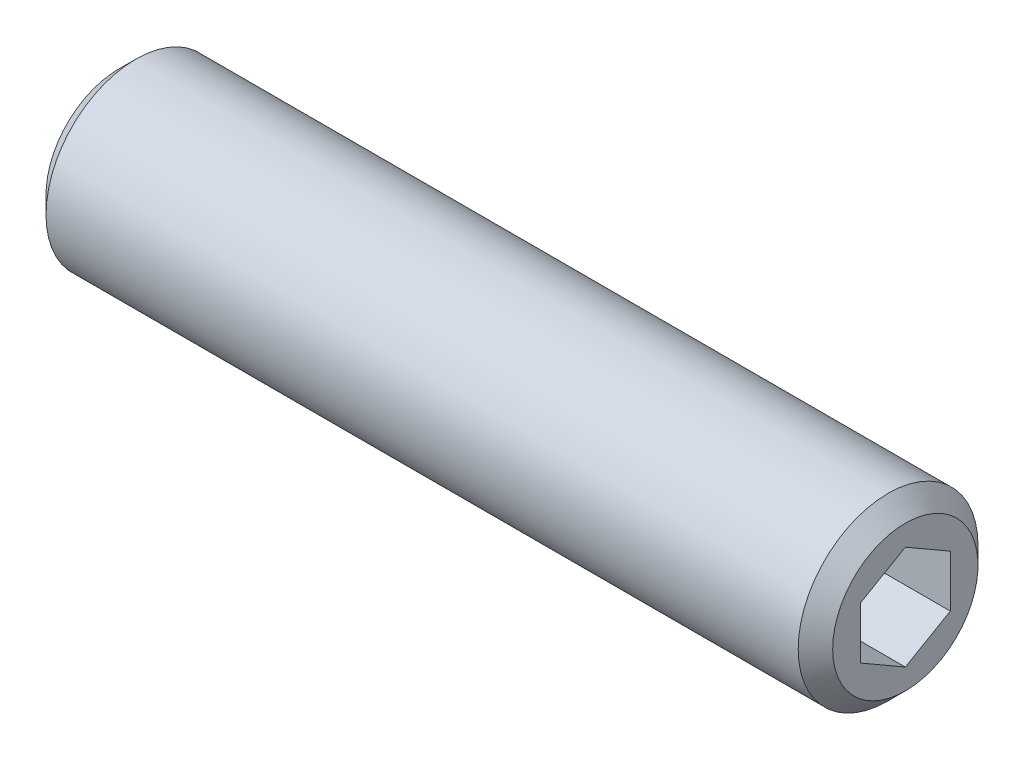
ISO-10303-21;
HEADER;
FILE_DESCRIPTION(('STEP AP214'),'2;1');
FILE_NAME('part.step','',(''),(''),'','','');
FILE_SCHEMA(('AUTOMOTIVE_DESIGN { 1 0 10303 214 1 1 1 1 }'));
ENDSEC;
DATA;
#1=APPLICATION_CONTEXT('core data for automotive mechanical design processes');
#2=APPLICATION_PROTOCOL_DEFINITION('international standard','automotive_design',2000,#1);
#3=PRODUCT_CONTEXT('',#1,'mechanical');
#4=PRODUCT('Part','Part','',(#3));
#5=PRODUCT_RELATED_PRODUCT_CATEGORY('part','',(#4));
#6=PRODUCT_DEFINITION_FORMATION('','',#4);
#7=PRODUCT_DEFINITION_CONTEXT('part definition',#1,'design');
#8=PRODUCT_DEFINITION('design','',#6,#7);
#9=PRODUCT_DEFINITION_SHAPE('','',#8);
#10=(LENGTH_UNIT() NAMED_UNIT(*) SI_UNIT(.MILLI.,.METRE.));
#11=(NAMED_UNIT(*) PLANE_ANGLE_UNIT() SI_UNIT($,.RADIAN.));
#12=(NAMED_UNIT(*) SI_UNIT($,.STERADIAN.) SOLID_ANGLE_UNIT());
#13=UNCERTAINTY_MEASURE_WITH_UNIT(LENGTH_MEASURE(1.E-05),#10,'distance_accuracy_value','');
#14=(GEOMETRIC_REPRESENTATION_CONTEXT(3) GLOBAL_UNCERTAINTY_ASSIGNED_CONTEXT((#13)) GLOBAL_UNIT_ASSIGNED_CONTEXT((#10,
#11,#12)) REPRESENTATION_CONTEXT('',''));
#15=CARTESIAN_POINT('',(0.,0.,0.));
#16=DIRECTION('',(0.,0.,1.));
#17=DIRECTION('',(1.,0.,0.));
#18=AXIS2_PLACEMENT_3D('',#15,#16,#17);
#19=CARTESIAN_POINT('',(30.0080000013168,0.,0.));
#20=DIRECTION('',(1.,0.,0.));
#21=DIRECTION('',(0.,0.,-1.));
#22=AXIS2_PLACEMENT_3D('',#19,#20,#21);
#23=CONICAL_SURFACE('',#22,2.32325748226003,1.04719754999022);
#24=CARTESIAN_POINT('',(28.666666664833,5.6843418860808E-11,0.));
#25=VERTEX_POINT('',#24);
#26=VERTEX_LOOP('',#25);
#27=FACE_BOUND('',#26,.T.);
#28=CARTESIAN_POINT('',(30.0000000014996,-1.15470053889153,1.99999999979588));
#29=CARTESIAN_POINT('',(29.9706955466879,-1.20544263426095,1.91211211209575));
#30=CARTESIAN_POINT('',(29.9440446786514,-1.25662273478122,1.82346557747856));
#31=CARTESIAN_POINT('',(29.8975263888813,-1.35986908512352,1.64463765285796));
#32=CARTESIAN_POINT('',(29.8776754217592,-1.41193716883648,1.55445308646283));
#33=CARTESIAN_POINT('',(29.8467759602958,-1.51542808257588,1.37520156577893));
#34=CARTESIAN_POINT('',(29.8355217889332,-1.56683499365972,1.28616218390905));
#35=CARTESIAN_POINT('',(29.8220891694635,-1.66989057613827,1.10766467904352));
#36=CARTESIAN_POINT('',(29.8198995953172,-1.72153887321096,1.01820720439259));
#37=CARTESIAN_POINT('',(29.8244662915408,-1.81803817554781,0.851065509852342));
#38=CARTESIAN_POINT('',(29.8301012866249,-1.86290366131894,0.773356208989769));
#39=CARTESIAN_POINT('',(29.8479573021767,-1.95234234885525,0.618443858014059));
#40=CARTESIAN_POINT('',(29.8601844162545,-1.99691524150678,0.541241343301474));
#41=CARTESIAN_POINT('',(29.8907498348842,-2.08653818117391,0.386009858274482));
#42=CARTESIAN_POINT('',(29.9092176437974,-2.13157689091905,0.308000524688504));
#43=CARTESIAN_POINT('',(29.9511317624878,-2.22098275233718,0.15314503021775));
#44=CARTESIAN_POINT('',(29.9745682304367,-2.26535104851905,0.0762968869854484));
#45=CARTESIAN_POINT('',(30.0000000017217,-2.30940107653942,3.79406241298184E-10));
#46=B_SPLINE_CURVE_WITH_KNOTS('',3,(#28,#29,#30,#31,#32,#33,#34,#35,#36,#37,#38,#39,#40,#41,#42,
#43,#44,#45),.UNSPECIFIED.,.F.,.F.,(4,2,2,2,2,2,2,2,4),(0.,0.317016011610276,0.634793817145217,
0.944707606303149,1.25424088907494,1.52370778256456,1.79342419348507,2.06912162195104,
2.34427797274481),.UNSPECIFIED.);
#47=CARTESIAN_POINT('',(30.000000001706,-1.15470053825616,1.99999999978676));
#48=VERTEX_POINT('',#47);
#49=CARTESIAN_POINT('',(30.0000000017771,-2.30940107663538,2.13202127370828E-10));
#50=VERTEX_POINT('',#49);
#51=EDGE_CURVE('E20',#48,#50,#46,.T.);
#52=ORIENTED_EDGE('',*,*,#51,.T.);
#53=CARTESIAN_POINT('',(30.0000000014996,-2.30940107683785,-5.45718177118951E-10));
#54=CARTESIAN_POINT('',(29.9706955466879,-2.2586589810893,-0.0878878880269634));
#55=CARTESIAN_POINT('',(29.9440446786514,-2.2074788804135,-0.176534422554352));
#56=CARTESIAN_POINT('',(29.8975263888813,-2.10423252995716,-0.355362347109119));
#57=CARTESIAN_POINT('',(29.8776754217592,-2.05216444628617,-0.445546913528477));
#58=CARTESIAN_POINT('',(29.8467759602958,-1.94867353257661,-0.624798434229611));
#59=CARTESIAN_POINT('',(29.8355217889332,-1.89726662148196,-0.713837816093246));
#60=CARTESIAN_POINT('',(29.8220891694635,-1.79421103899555,-0.892335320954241));
#61=CARTESIAN_POINT('',(29.8198995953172,-1.74256274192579,-0.98179279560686));
#62=CARTESIAN_POINT('',(29.8244662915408,-1.64606343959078,-1.14893449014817));
#63=CARTESIAN_POINT('',(29.8301012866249,-1.60119795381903,-1.22664379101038));
#64=CARTESIAN_POINT('',(29.8479573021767,-1.51175926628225,-1.38155614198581));
#65=CARTESIAN_POINT('',(29.8601844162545,-1.46718637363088,-1.45875865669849));
#66=CARTESIAN_POINT('',(29.8907498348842,-1.37756343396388,-1.61399014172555));
#67=CARTESIAN_POINT('',(29.9092176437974,-1.3325247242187,-1.69199947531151));
#68=CARTESIAN_POINT('',(29.9511317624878,-1.2431188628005,-1.84685496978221));
#69=CARTESIAN_POINT('',(29.9745682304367,-1.19875056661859,-1.92370311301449));
#70=CARTESIAN_POINT('',(30.0000000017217,-1.15470053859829,-1.99999999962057));
#71=B_SPLINE_CURVE_WITH_KNOTS('',3,(#53,#54,#55,#56,#57,#58,#59,#60,#61,#62,#63,#64,#65,#66,#67,
#68,#69,#70),.UNSPECIFIED.,.F.,.F.,(4,2,2,2,2,2,2,2,4),(0.,0.317016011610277,0.634793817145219,
0.944707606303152,1.25424088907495,1.52370778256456,1.79342419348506,2.06912162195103,
2.34427797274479),.UNSPECIFIED.);
#72=CARTESIAN_POINT('',(30.0000000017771,-1.15470053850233,-1.99999999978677));
#73=VERTEX_POINT('',#72);
#74=EDGE_CURVE('E110',#50,#73,#71,.T.);
#75=ORIENTED_EDGE('',*,*,#74,.T.);
#76=CARTESIAN_POINT('',(30.0000000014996,-1.15470053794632,-2.00000000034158));
#77=CARTESIAN_POINT('',(29.9706955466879,-1.05321634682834,-2.00000000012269));
#78=CARTESIAN_POINT('',(29.9440446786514,-0.950856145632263,-2.0000000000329));
#79=CARTESIAN_POINT('',(29.8975263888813,-0.744363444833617,-1.99999999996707));
#80=CARTESIAN_POINT('',(29.8776754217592,-0.640227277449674,-1.9999999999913));
#81=CARTESIAN_POINT('',(29.8467759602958,-0.433245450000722,-2.00000000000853));
#82=CARTESIAN_POINT('',(29.8355217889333,-0.330431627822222,-2.00000000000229));
#83=CARTESIAN_POINT('',(29.8220891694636,-0.124320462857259,-1.99999999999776));
#84=CARTESIAN_POINT('',(29.8198995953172,-0.0210238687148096,-1.99999999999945));
#85=CARTESIAN_POINT('',(29.8244662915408,0.171974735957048,-2.00000000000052));
#86=CARTESIAN_POINT('',(29.8301012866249,0.261705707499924,-2.00000000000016));
#87=CARTESIAN_POINT('',(29.8479573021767,0.440583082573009,-1.99999999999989));
#88=CARTESIAN_POINT('',(29.8601844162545,0.529728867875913,-1.99999999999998));
#89=CARTESIAN_POINT('',(29.8907498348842,0.708974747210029,-2.00000000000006));
#90=CARTESIAN_POINT('',(29.9092176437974,0.799052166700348,-2.00000000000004));
#91=CARTESIAN_POINT('',(29.9511317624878,0.977863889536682,-2.));
#92=CARTESIAN_POINT('',(29.9745682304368,1.06660048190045,-1.99999999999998));
#93=CARTESIAN_POINT('',(30.0000000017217,1.15470053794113,-2.00000000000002));
#94=B_SPLINE_CURVE_WITH_KNOTS('',3,(#76,#77,#78,#79,#80,#81,#82,#83,#84,#85,#86,#87,#88,#89,#90,
#91,#92,#93),.UNSPECIFIED.,.F.,.F.,(4,2,2,2,2,2,2,2,4),(0.,0.317016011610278,0.634793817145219,
0.944707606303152,1.25424088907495,1.52370778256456,1.79342419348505,2.06912162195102,
2.34427797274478),.UNSPECIFIED.);
#95=CARTESIAN_POINT('',(30.0000000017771,1.15470053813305,-2.));
#96=VERTEX_POINT('',#95);
#97=EDGE_CURVE('E106',#73,#96,#94,.T.);
#98=ORIENTED_EDGE('',*,*,#97,.T.);
#99=CARTESIAN_POINT('',(30.0000000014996,1.15470053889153,-1.99999999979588));
#100=CARTESIAN_POINT('',(29.9706955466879,1.20544263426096,-1.91211211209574));
#101=CARTESIAN_POINT('',(29.9440446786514,1.25662273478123,-1.82346557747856));
#102=CARTESIAN_POINT('',(29.8975263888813,1.35986908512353,-1.64463765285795));
#103=CARTESIAN_POINT('',(29.8776754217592,1.41193716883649,-1.55445308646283));
#104=CARTESIAN_POINT('',(29.8467759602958,1.51542808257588,-1.37520156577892));
#105=CARTESIAN_POINT('',(29.8355217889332,1.56683499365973,-1.28616218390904));
#106=CARTESIAN_POINT('',(29.8220891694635,1.66989057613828,-1.10766467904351));
#107=CARTESIAN_POINT('',(29.8198995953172,1.72153887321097,-1.01820720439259));
#108=CARTESIAN_POINT('',(29.8244662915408,1.81803817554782,-0.851065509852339));
#109=CARTESIAN_POINT('',(29.8301012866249,1.86290366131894,-0.773356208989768));
#110=CARTESIAN_POINT('',(29.8479573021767,1.95234234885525,-0.618443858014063));
#111=CARTESIAN_POINT('',(29.8601844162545,1.99691524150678,-0.54124134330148));
#112=CARTESIAN_POINT('',(29.8907498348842,2.08653818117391,-0.386009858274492));
#113=CARTESIAN_POINT('',(29.9092176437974,2.13157689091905,-0.308000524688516));
#114=CARTESIAN_POINT('',(29.9511317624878,2.22098275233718,-0.153145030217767));
#115=CARTESIAN_POINT('',(29.9745682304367,2.26535104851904,-0.0762968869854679));
#116=CARTESIAN_POINT('',(30.0000000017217,2.30940107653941,-3.79427652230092E-10));
#117=B_SPLINE_CURVE_WITH_KNOTS('',3,(#99,#100,#101,#102,#103,#104,#105,#106,#107,#108,#109,#110,
#111,#112,#113,#114,#115,#116),.UNSPECIFIED.,.F.,.F.,(4,2,2,2,2,2,2,2,4),(0.,0.317016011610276,
0.634793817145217,0.94470760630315,1.25424088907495,1.52370778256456,1.79342419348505,
2.06912162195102,2.34427797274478),.UNSPECIFIED.);
#118=CARTESIAN_POINT('',(30.0000000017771,2.30940107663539,-2.13231902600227E-10));
#119=VERTEX_POINT('',#118);
#120=EDGE_CURVE('E102',#96,#119,#117,.T.);
#121=ORIENTED_EDGE('',*,*,#120,.T.);
#122=CARTESIAN_POINT('',(30.0000000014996,2.30940107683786,5.45690230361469E-10));
#123=CARTESIAN_POINT('',(29.9706955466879,2.25865898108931,0.0878878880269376));
#124=CARTESIAN_POINT('',(29.9440446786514,2.20747888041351,0.176534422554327));
#125=CARTESIAN_POINT('',(29.8975263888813,2.10423252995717,0.355362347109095));
#126=CARTESIAN_POINT('',(29.8776754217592,2.05216444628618,0.445546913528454));
#127=CARTESIAN_POINT('',(29.8467759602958,1.94867353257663,0.624798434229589));
#128=CARTESIAN_POINT('',(29.8355217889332,1.89726662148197,0.713837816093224));
#129=CARTESIAN_POINT('',(29.8220891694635,1.79421103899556,0.89233532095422));
#130=CARTESIAN_POINT('',(29.8198995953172,1.7425627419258,0.98179279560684));
#131=CARTESIAN_POINT('',(29.8244662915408,1.64606343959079,1.14893449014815));
#132=CARTESIAN_POINT('',(29.8301012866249,1.60119795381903,1.22664379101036));
#133=CARTESIAN_POINT('',(29.8479573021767,1.51175926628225,1.3815561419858));
#134=CARTESIAN_POINT('',(29.8601844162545,1.46718637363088,1.45875865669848));
#135=CARTESIAN_POINT('',(29.8907498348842,1.37756343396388,1.61399014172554));
#136=CARTESIAN_POINT('',(29.9092176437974,1.3325247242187,1.6919994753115));
#137=CARTESIAN_POINT('',(29.9511317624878,1.2431188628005,1.84685496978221));
#138=CARTESIAN_POINT('',(29.9745682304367,1.19875056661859,1.92370311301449));
#139=CARTESIAN_POINT('',(30.0000000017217,1.15470053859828,1.99999999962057));
#140=B_SPLINE_CURVE_WITH_KNOTS('',3,(#122,#123,#124,#125,#126,#127,#128,#129,#130,#131,#132,
#133,#134,#135,#136,#137,#138,#139),.UNSPECIFIED.,.F.,.F.,(4,2,2,2,2,2,2,2,4),(0.,
0.317016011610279,0.634793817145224,0.944707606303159,1.25424088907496,1.52370778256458,
1.79342419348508,2.06912162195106,2.34427797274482),.UNSPECIFIED.);
#141=CARTESIAN_POINT('',(30.0000000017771,1.15470053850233,1.99999999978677));
#142=VERTEX_POINT('',#141);
#143=EDGE_CURVE('E85',#119,#142,#140,.T.);
#144=ORIENTED_EDGE('',*,*,#143,.T.);
#145=CARTESIAN_POINT('',(30.0000000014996,1.15470053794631,2.00000000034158));
#146=CARTESIAN_POINT('',(29.9706955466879,1.05321634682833,2.00000000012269));
#147=CARTESIAN_POINT('',(29.9440446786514,0.950856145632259,2.0000000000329));
#148=CARTESIAN_POINT('',(29.8975263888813,0.744363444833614,1.99999999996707));
#149=CARTESIAN_POINT('',(29.8776754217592,0.640227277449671,1.9999999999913));
#150=CARTESIAN_POINT('',(29.8467759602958,0.433245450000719,2.00000000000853));
#151=CARTESIAN_POINT('',(29.8355217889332,0.33043162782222,2.00000000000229));
#152=CARTESIAN_POINT('',(29.8220891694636,0.124320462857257,1.99999999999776));
#153=CARTESIAN_POINT('',(29.8198995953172,0.0210238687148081,1.99999999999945));
#154=CARTESIAN_POINT('',(29.8244662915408,-0.171974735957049,2.00000000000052));
#155=CARTESIAN_POINT('',(29.8301012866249,-0.261705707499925,2.00000000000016));
#156=CARTESIAN_POINT('',(29.8479573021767,-0.440583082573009,1.99999999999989));
#157=CARTESIAN_POINT('',(29.8601844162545,-0.529728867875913,1.99999999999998));
#158=CARTESIAN_POINT('',(29.8907498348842,-0.708974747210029,2.00000000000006));
#159=CARTESIAN_POINT('',(29.9092176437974,-0.799052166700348,2.00000000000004));
#160=CARTESIAN_POINT('',(29.9511317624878,-0.977863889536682,2.));
#161=CARTESIAN_POINT('',(29.9745682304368,-1.06660048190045,1.99999999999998));
#162=CARTESIAN_POINT('',(30.0000000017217,-1.15470053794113,2.00000000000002));
#163=B_SPLINE_CURVE_WITH_KNOTS('',3,(#145,#146,#147,#148,#149,#150,#151,#152,#153,#154,#155,
#156,#157,#158,#159,#160,#161,#162),.UNSPECIFIED.,.F.,.F.,(4,2,2,2,2,2,2,2,4),(0.,
0.317016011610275,0.634793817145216,0.944707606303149,1.25424088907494,1.52370778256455,
1.79342419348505,2.06912162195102,2.34427797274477),.UNSPECIFIED.);
#164=EDGE_CURVE('E83',#142,#48,#163,.T.);
#165=ORIENTED_EDGE('',*,*,#164,.T.);
#166=EDGE_LOOP('',(#52,#75,#98,#121,#144,#165));
#167=FACE_BOUND('',#166,.T.);
#168=ADVANCED_FACE('F16',(#27,#167),#23,.F.);
#169=CARTESIAN_POINT('',(35.,-1.15470053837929,1.99999999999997));
#170=DIRECTION('',(0.,-0.866025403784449,0.499999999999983));
#171=DIRECTION('',(0.,-0.499999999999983,-0.866025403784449));
#172=AXIS2_PLACEMENT_3D('',#169,#170,#171);
#173=PLANE('',#172);
#174=DIRECTION('',(1.,0.,0.));
#175=VECTOR('',#174,1.);
#176=CARTESIAN_POINT('',(35.,-1.15470053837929,2.00000000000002));
#177=LINE('',#176,#175);
#178=CARTESIAN_POINT('',(35.,-1.15470053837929,2.00000000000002));
#179=VERTEX_POINT('',#178);
#180=EDGE_CURVE('E76',#48,#179,#177,.T.);
#181=ORIENTED_EDGE('',*,*,#180,.T.);
#182=DIRECTION('',(0.,-0.499999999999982,-0.866025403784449));
#183=VECTOR('',#182,1.);
#184=CARTESIAN_POINT('',(35.,-1.15470053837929,1.99999999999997));
#185=LINE('',#184,#183);
#186=CARTESIAN_POINT('',(35.,-2.3094010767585,0.));
#187=VERTEX_POINT('',#186);
#188=EDGE_CURVE('E87',#179,#187,#185,.T.);
#189=ORIENTED_EDGE('',*,*,#188,.T.);
#190=DIRECTION('',(1.,0.,0.));
#191=VECTOR('',#190,1.);
#192=CARTESIAN_POINT('',(35.,-2.3094010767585,0.));
#193=LINE('',#192,#191);
#194=EDGE_CURVE('E79',#187,#50,#193,.F.);
#195=ORIENTED_EDGE('',*,*,#194,.T.);
#196=ORIENTED_EDGE('',*,*,#51,.F.);
#197=EDGE_LOOP('',(#181,#189,#195,#196));
#198=FACE_BOUND('',#197,.T.);
#199=ADVANCED_FACE('F74',(#198),#173,.F.);
#200=CARTESIAN_POINT('',(35.,-2.3094010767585,0.));
#201=DIRECTION('',(0.,-0.866025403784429,-0.500000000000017));
#202=DIRECTION('',(0.,0.500000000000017,-0.866025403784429));
#203=AXIS2_PLACEMENT_3D('',#200,#201,#202);
#204=PLANE('',#203);
#205=ORIENTED_EDGE('',*,*,#194,.F.);
#206=DIRECTION('',(0.,0.500000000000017,-0.866025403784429));
#207=VECTOR('',#206,1.);
#208=CARTESIAN_POINT('',(35.,-2.3094010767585,0.));
#209=LINE('',#208,#207);
#210=CARTESIAN_POINT('',(35.,-1.15470053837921,-2.00000000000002));
#211=VERTEX_POINT('',#210);
#212=EDGE_CURVE('E117',#187,#211,#209,.T.);
#213=ORIENTED_EDGE('',*,*,#212,.T.);
#214=DIRECTION('',(-1.,0.,0.));
#215=VECTOR('',#214,1.);
#216=CARTESIAN_POINT('',(35.,-1.15470053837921,-2.00000000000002));
#217=LINE('',#216,#215);
#218=EDGE_CURVE('E107',#211,#73,#217,.T.);
#219=ORIENTED_EDGE('',*,*,#218,.T.);
#220=ORIENTED_EDGE('',*,*,#74,.F.);
#221=EDGE_LOOP('',(#205,#213,#219,#220));
#222=FACE_BOUND('',#221,.T.);
#223=ADVANCED_FACE('F162',(#222),#204,.F.);
#224=CARTESIAN_POINT('',(35.,-1.15470053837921,-2.00000000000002));
#225=DIRECTION('',(0.,0.,-1.));
#226=DIRECTION('',(-1.,0.,0.));
#227=AXIS2_PLACEMENT_3D('',#224,#225,#226);
#228=PLANE('',#227);
#229=ORIENTED_EDGE('',*,*,#218,.F.);
#230=DIRECTION('',(0.,1.,0.));
#231=VECTOR('',#230,1.);
#232=CARTESIAN_POINT('',(35.,0.,-2.00000000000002));
#233=LINE('',#232,#231);
#234=CARTESIAN_POINT('',(35.,1.15470053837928,-1.99999999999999));
#235=VERTEX_POINT('',#234);
#236=EDGE_CURVE('E119',#211,#235,#233,.T.);
#237=ORIENTED_EDGE('',*,*,#236,.T.);
#238=DIRECTION('',(1.,0.,0.));
#239=VECTOR('',#238,1.);
#240=CARTESIAN_POINT('',(35.,1.15470053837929,-1.99999999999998));
#241=LINE('',#240,#239);
#242=EDGE_CURVE('E103',#235,#96,#241,.F.);
#243=ORIENTED_EDGE('',*,*,#242,.T.);
#244=ORIENTED_EDGE('',*,*,#97,.F.);
#245=EDGE_LOOP('',(#229,#237,#243,#244));
#246=FACE_BOUND('',#245,.T.);
#247=ADVANCED_FACE('F148',(#246),#228,.F.);
#248=CARTESIAN_POINT('',(35.,1.15470053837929,-1.99999999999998));
#249=DIRECTION('',(0.,0.866025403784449,-0.499999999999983));
#250=DIRECTION('',(0.,0.499999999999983,0.866025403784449));
#251=AXIS2_PLACEMENT_3D('',#248,#249,#250);
#252=PLANE('',#251);
#253=ORIENTED_EDGE('',*,*,#242,.F.);
#254=DIRECTION('',(0.,0.499999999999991,0.866025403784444));
#255=VECTOR('',#254,1.);
#256=CARTESIAN_POINT('',(35.,1.15470053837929,-1.99999999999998));
#257=LINE('',#256,#255);
#258=CARTESIAN_POINT('',(35.,2.30940107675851,0.));
#259=VERTEX_POINT('',#258);
#260=EDGE_CURVE('E113',#235,#259,#257,.T.);
#261=ORIENTED_EDGE('',*,*,#260,.T.);
#262=DIRECTION('',(1.,0.,0.));
#263=VECTOR('',#262,1.);
#264=CARTESIAN_POINT('',(35.,2.30940107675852,0.));
#265=LINE('',#264,#263);
#266=EDGE_CURVE('E96',#259,#119,#265,.F.);
#267=ORIENTED_EDGE('',*,*,#266,.T.);
#268=ORIENTED_EDGE('',*,*,#120,.F.);
#269=EDGE_LOOP('',(#253,#261,#267,#268));
#270=FACE_BOUND('',#269,.T.);
#271=ADVANCED_FACE('F144',(#270),#252,.F.);
#272=CARTESIAN_POINT('',(35.,2.3094010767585,0.));
#273=DIRECTION('',(0.,0.866025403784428,0.500000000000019));
#274=DIRECTION('',(0.,-0.500000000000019,0.866025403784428));
#275=AXIS2_PLACEMENT_3D('',#272,#273,#274);
#276=PLANE('',#275);
#277=ORIENTED_EDGE('',*,*,#266,.F.);
#278=DIRECTION('',(0.,-0.50000000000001,0.866025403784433));
#279=VECTOR('',#278,1.);
#280=CARTESIAN_POINT('',(35.,2.3094010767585,0.));
#281=LINE('',#280,#279);
#282=CARTESIAN_POINT('',(35.,1.15470053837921,2.00000000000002));
#283=VERTEX_POINT('',#282);
#284=EDGE_CURVE('E38',#259,#283,#281,.T.);
#285=ORIENTED_EDGE('',*,*,#284,.T.);
#286=DIRECTION('',(1.,0.,0.));
#287=VECTOR('',#286,1.);
#288=CARTESIAN_POINT('',(35.,1.15470053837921,2.00000000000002));
#289=LINE('',#288,#287);
#290=EDGE_CURVE('E88',#283,#142,#289,.F.);
#291=ORIENTED_EDGE('',*,*,#290,.T.);
#292=ORIENTED_EDGE('',*,*,#143,.F.);
#293=EDGE_LOOP('',(#277,#285,#291,#292));
#294=FACE_BOUND('',#293,.T.);
#295=ADVANCED_FACE('F139',(#294),#276,.F.);
#296=CARTESIAN_POINT('',(35.,1.15470053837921,2.00000000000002));
#297=DIRECTION('',(0.,0.,1.));
#298=DIRECTION('',(1.,0.,0.));
#299=AXIS2_PLACEMENT_3D('',#296,#297,#298);
#300=PLANE('',#299);
#301=ORIENTED_EDGE('',*,*,#290,.F.);
#302=DIRECTION('',(0.,1.,0.));
#303=VECTOR('',#302,1.);
#304=CARTESIAN_POINT('',(35.,0.,2.00000000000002));
#305=LINE('',#304,#303);
#306=EDGE_CURVE('E92',#283,#179,#305,.F.);
#307=ORIENTED_EDGE('',*,*,#306,.T.);
#308=ORIENTED_EDGE('',*,*,#180,.F.);
#309=ORIENTED_EDGE('',*,*,#164,.F.);
#310=EDGE_LOOP('',(#301,#307,#308,#309));
#311=FACE_BOUND('',#310,.T.);
#312=ADVANCED_FACE('F90',(#311),#300,.F.);
#313=CARTESIAN_POINT('',(35.,0.,0.));
#314=DIRECTION('',(-1.,0.,0.));
#315=DIRECTION('',(0.,0.,1.));
#316=AXIS2_PLACEMENT_3D('',#313,#314,#315);
#317=PLANE('',#316);
#318=ORIENTED_EDGE('',*,*,#284,.F.);
#319=ORIENTED_EDGE('',*,*,#260,.F.);
#320=ORIENTED_EDGE('',*,*,#236,.F.);
#321=ORIENTED_EDGE('',*,*,#212,.F.);
#322=ORIENTED_EDGE('',*,*,#188,.F.);
#323=ORIENTED_EDGE('',*,*,#306,.F.);
#324=EDGE_LOOP('',(#318,#319,#320,#321,#322,#323));
#325=FACE_BOUND('',#324,.T.);
#326=CARTESIAN_POINT('',(35.0000000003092,0.,0.));
#327=DIRECTION('',(-1.,0.,0.));
#328=DIRECTION('',(0.,0.,1.));
#329=AXIS2_PLACEMENT_3D('',#326,#327,#328);
#330=CIRCLE('',#329,3.23318750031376);
#331=CARTESIAN_POINT('',(35.0000000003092,0.,3.23318750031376));
#332=VERTEX_POINT('',#331);
#333=EDGE_CURVE('E115',#332,#332,#330,.T.);
#334=ORIENTED_EDGE('',*,*,#333,.F.);
#335=EDGE_LOOP('',(#334));
#336=FACE_BOUND('',#335,.T.);
#337=ADVANCED_FACE('F138',(#325,#336),#317,.F.);
#338=CARTESIAN_POINT('',(0.,2.,0.));
#339=DIRECTION('',(-1.,0.,0.));
#340=DIRECTION('',(0.,0.,1.));
#341=AXIS2_PLACEMENT_3D('',#338,#339,#340);
#342=PLANE('',#341);
#343=CARTESIAN_POINT('',(-3.41060621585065E-10,0.,0.));
#344=DIRECTION('',(1.,0.,0.));
#345=DIRECTION('',(0.,1.,0.));
#346=AXIS2_PLACEMENT_3D('',#343,#344,#345);
#347=CIRCLE('',#346,3.23318750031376);
#348=CARTESIAN_POINT('',(-3.41060796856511E-10,3.23318750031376,0.));
#349=VERTEX_POINT('',#348);
#350=EDGE_CURVE('E122',#349,#349,#347,.T.);
#351=ORIENTED_EDGE('',*,*,#350,.F.);
#352=EDGE_LOOP('',(#351));
#353=FACE_BOUND('',#352,.T.);
#354=ADVANCED_FACE('F187',(#353),#342,.T.);
#355=CARTESIAN_POINT('',(34.2331874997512,0.,0.));
#356=DIRECTION('',(-1.,0.,0.));
#357=DIRECTION('',(0.,0.,1.));
#358=AXIS2_PLACEMENT_3D('',#355,#356,#357);
#359=CONICAL_SURFACE('',#358,3.99999999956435,0.785398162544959);
#360=ORIENTED_EDGE('',*,*,#333,.T.);
#361=EDGE_LOOP('',(#360));
#362=FACE_BOUND('',#361,.T.);
#363=CARTESIAN_POINT('',(34.2331875,0.,0.));
#364=DIRECTION('',(1.,0.,0.));
#365=DIRECTION('',(0.,1.,0.));
#366=AXIS2_PLACEMENT_3D('',#363,#364,#365);
#367=CIRCLE('',#366,4.);
#368=CARTESIAN_POINT('',(34.2331875,4.,0.));
#369=VERTEX_POINT('',#368);
#370=EDGE_CURVE('E29',#369,#369,#367,.F.);
#371=ORIENTED_EDGE('',*,*,#370,.F.);
#372=EDGE_LOOP('',(#371));
#373=FACE_BOUND('',#372,.T.);
#374=ADVANCED_FACE('F181',(#362,#373),#359,.T.);
#375=CARTESIAN_POINT('',(0.766812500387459,0.,0.));
#376=DIRECTION('',(1.,0.,0.));
#377=DIRECTION('',(0.,1.,0.));
#378=AXIS2_PLACEMENT_3D('',#375,#376,#377);
#379=CONICAL_SURFACE('',#378,3.9999999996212,0.78539816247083);
#380=CARTESIAN_POINT('',(0.766812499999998,0.,0.));
#381=DIRECTION('',(1.,0.,0.));
#382=DIRECTION('',(0.,1.,0.));
#383=AXIS2_PLACEMENT_3D('',#380,#381,#382);
#384=CIRCLE('',#383,4.);
#385=CARTESIAN_POINT('',(0.766812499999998,4.,0.));
#386=VERTEX_POINT('',#385);
#387=EDGE_CURVE('E11',#386,#386,#384,.T.);
#388=ORIENTED_EDGE('',*,*,#387,.F.);
#389=EDGE_LOOP('',(#388));
#390=FACE_BOUND('',#389,.T.);
#391=ORIENTED_EDGE('',*,*,#350,.T.);
#392=EDGE_LOOP('',(#391));
#393=FACE_BOUND('',#392,.T.);
#394=ADVANCED_FACE('F175',(#390,#393),#379,.T.);
#395=CARTESIAN_POINT('',(17.5,0.,0.));
#396=DIRECTION('',(1.,0.,0.));
#397=DIRECTION('',(0.,1.,0.));
#398=AXIS2_PLACEMENT_3D('',#395,#396,#397);
#399=CYLINDRICAL_SURFACE('',#398,4.);
#400=ORIENTED_EDGE('',*,*,#387,.T.);
#401=EDGE_LOOP('',(#400));
#402=FACE_BOUND('',#401,.T.);
#403=ORIENTED_EDGE('',*,*,#370,.T.);
#404=EDGE_LOOP('',(#403));
#405=FACE_BOUND('',#404,.T.);
#406=ADVANCED_FACE('F173',(#402,#405),#399,.T.);
#407=CLOSED_SHELL('',(#168,#199,#223,#247,#271,#295,#312,#337,#354,#374,#394,#406));
#408=MANIFOLD_SOLID_BREP('B1',#407);
#409=ADVANCED_BREP_SHAPE_REPRESENTATION('',(#18,#408),#14);
#410=SHAPE_DEFINITION_REPRESENTATION(#9,#409);
ENDSEC;
END-ISO-10303-21;
